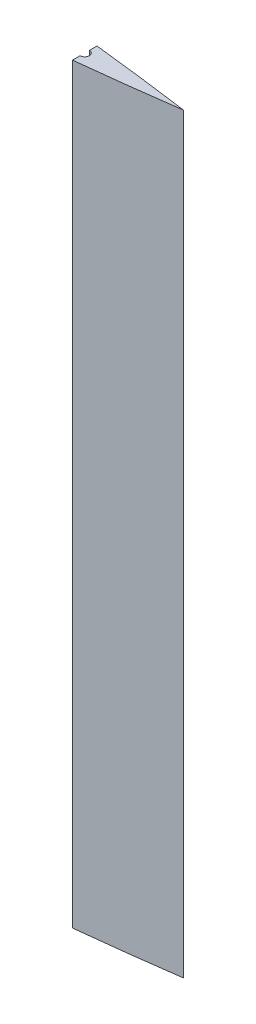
from build123d import *

# Parameters (mm, degrees)
BOSS_EXTRUDE1_DEPTH     = 3.175
SKETCH2_R               = 1.5
CUT_EXTRUDE1_DEPTH      = 3.175
SKETCH3_R               = 1.5
CUT_EXTRUDE2_DEPTH      = 1.5875
CUT_EXTRUDE3_DEPTH      = 75.025896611
CUT_EXTRUDE3_DEPTH_BACK = 75.025896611
BOSS_EXTRUDE2_START     = 244
BOSS_EXTRUDE2_DEPTH     = 244
CUT_EXTRUDE4_DEPTH      = 252.925452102
CUT_EXTRUDE4_DEPTH_BACK = 252.925452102


with BuildPart() as part:
    # Sketch1 → Boss-Extrude1 (new body)
    with BuildSketch(Plane(origin=(0, 0, 0), x_dir=(1, 0, 0), z_dir=(0, 1, 0))):
        with BuildLine():
            Line((67.779039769, 0.131246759), (67.797892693, 0.119555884))
            add(Edge.make_bspline(
                [(67.779039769, 0.131246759), (65.03700686, 0.509034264), (59.965261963, 1.213250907), (52.554471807, 2.158374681), (45.554393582, 3.00647836), (36.223889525, 4.068832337), (26.890333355, 5.041842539), (17.553968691, 5.919437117), (10.553820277, 6.521297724), (3.553925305, 7.068029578), (-3.492800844, 7.550143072), (-10.539316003, 7.962714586), (-17.586579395, 8.268185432), (-24.587039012, 8.49389358), (-30.375678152, 8.4899488), (-34.994971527, 8.597521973), (-40.781764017, 8.678102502), (-47.788121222, 8.68162886), (-54.793770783, 8.311674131), (-59.226305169, 7.818234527), (-62.265674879, 7.319870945), (-64.600903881, 6.788432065), (-66.462046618, 6.225735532), (-67.870705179, 5.710888), (-69.287641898, 5.065294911), (-70.729671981, 4.219380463), (-71.925873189, 3.230084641), (-72.979383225, 1.905868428), (-73.75481754, 0.124102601), (-72.979383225, -1.657663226), (-71.925873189, -2.981879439), (-70.729671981, -3.971175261), (-69.287641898, -4.817089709), (-67.870705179, -5.462682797), (-66.462046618, -5.97753033), (-64.600903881, -6.540226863), (-62.265674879, -7.071665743), (-59.226305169, -7.570029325), (-54.793770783, -8.063468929), (-47.788121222, -8.433423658), (-40.781764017, -8.4298973), (-34.994971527, -8.349316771), (-30.375678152, -8.241743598), (-24.587039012, -8.245688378), (-17.586579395, -8.01998023), (-10.539316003, -7.714509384), (-3.492800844, -7.30193787), (3.553925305, -6.819824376), (10.553820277, -6.273092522), (17.553968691, -5.671231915), (26.890333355, -4.793637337), (36.223889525, -3.820627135), (45.554393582, -2.758273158), (52.554471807, -1.910169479), (59.971554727, -0.964243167), (65.049573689, -0.259084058), (67.797892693, 0.119555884)],
                knots=[-0.004320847, -0.004320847, -0.004320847, -0.004320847, 0.024634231, 0.04924287, 0.07382978, 0.098396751, 0.147478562, 0.171994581, 0.196493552, 0.220976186, 0.245442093, 0.270380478, 0.294812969, 0.319231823, 0.343641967, 0.355360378, 0.36756608, 0.404182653, 0.428636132, 0.440920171, 0.450818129, 0.460843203, 0.465945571, 0.471149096, 0.476522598, 0.482208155, 0.488618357, 0.492567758, 0.5, 0.507432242, 0.511381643, 0.517791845, 0.523477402, 0.528850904, 0.534054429, 0.539156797, 0.549181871, 0.559079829, 0.571363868, 0.595817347, 0.63243392, 0.644639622, 0.656358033, 0.680768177, 0.705187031, 0.729619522, 0.754557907, 0.779023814, 0.803506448, 0.828005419, 0.852521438, 0.901603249, 0.92617022, 0.95075713, 0.975365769, 1.004387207, 1.004387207, 1.004387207, 1.004387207], degree=3))
        make_face()
    extrude(amount=BOSS_EXTRUDE1_DEPTH)

    # Sketch2 → Cut-Extrude1 (cut)
    with BuildSketch(Plane(origin=(0, 3.175, 0), x_dir=(1, 0, 0), z_dir=(0, 1, 0))):
        with Locations(Location((35.779039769, 0.131246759, 0), (0, 0, 270))):
            Circle(SKETCH2_R)
    extrude(amount=-CUT_EXTRUDE1_DEPTH, mode=Mode.SUBTRACT)

    # Sketch3 → Cut-Extrude2 (cut)
    with BuildSketch(Plane.XZ):
        with Locations(Location((-52.19848551, -0.119555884, 0), (0, 0, 270))):
            Circle(SKETCH3_R)
    extrude(amount=-CUT_EXTRUDE2_DEPTH, mode=Mode.SUBTRACT)

    # Sketch4 → Cut-Extrude3 (cut, two sides: drawn at the far end of the back side and taken through both)
    with BuildSketch(Plane(origin=(0, 3.175, 0), x_dir=(1, 0, 0), z_dir=(0, 1, 0)).offset(-CUT_EXTRUDE3_DEPTH_BACK)):
        with BuildLine():
            Line((35.779039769, 4.09956648), (35.779039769, 1.631246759))
            ThreePointArc((35.779039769, 1.631246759), (37.279039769, 0.131246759), (35.779039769, -1.368753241))
            Line((35.779039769, -1.368753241), (35.779039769, -3.851361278))
            add(Edge.make_bspline(
                [(35.779039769, -3.851361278), (36.703324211, -3.751450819), (39.962012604, -3.395011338), (45.554393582, -2.758273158), (52.554471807, -1.910169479), (59.971554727, -0.964243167), (65.049573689, -0.259084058), (67.797892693, 0.119555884)],
                knots=[0.891878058, 0.891878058, 0.891878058, 0.891878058, 0.901603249, 0.92617022, 0.95075713, 0.975365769, 1.004387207, 1.004387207, 1.004387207, 1.004387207], degree=3))
            Line((67.797892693, 0.119555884), (67.779039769, 0.131246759))
            add(Edge.make_bspline(
                [(67.779039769, 0.131246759), (65.03700686, 0.509034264), (59.965261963, 1.213250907), (52.554471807, 2.158374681), (45.554393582, 3.00647836), (39.962012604, 3.64321654), (36.703324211, 3.999656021), (35.779039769, 4.09956648)],
                knots=[-0.004320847, -0.004320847, -0.004320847, -0.004320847, 0.024634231, 0.04924287, 0.07382978, 0.098396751, 0.108121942, 0.108121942, 0.108121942, 0.108121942], degree=3))
        make_face()
    extrude(amount=CUT_EXTRUDE3_DEPTH + CUT_EXTRUDE3_DEPTH_BACK, mode=Mode.SUBTRACT)

    # Sketch5 → Boss-Extrude2 (add)
    with BuildSketch(Plane(origin=(0, 0, 0), x_dir=(1, 0, 0), z_dir=(0, 1, 0)).offset(BOSS_EXTRUDE2_START)):
        with BuildLine():
            Line((35.779039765, -1.368753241), (35.779039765, -3.851361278))
            add(Edge.make_bspline(
                [(35.779039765, -3.851361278), (36.703324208, -3.751450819), (39.9620126, -3.395011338), (45.554393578, -2.758273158), (52.554471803, -1.910169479), (59.971554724, -0.964243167), (65.049573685, -0.259084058), (67.79789269, 0.119555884)],
                knots=[0.891878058, 0.891878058, 0.891878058, 0.891878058, 0.901603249, 0.92617022, 0.95075713, 0.975365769, 1.004387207, 1.004387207, 1.004387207, 1.004387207], degree=3))
            Line((67.79789269, 0.119555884), (67.830893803, 0.124102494))
            Line((67.830893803, 0.124102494), (67.779039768, 0.131246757))
            add(Edge.make_bspline(
                [(67.779039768, 0.131246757), (65.03700686, 0.509034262), (59.965261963, 1.213250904), (52.554471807, 2.158374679), (45.554393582, 3.006478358), (39.962012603, 3.643216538), (36.703324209, 3.999656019), (35.779039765, 4.099566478)],
                knots=[-0.004320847, -0.004320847, -0.004320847, -0.004320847, 0.024634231, 0.04924287, 0.07382978, 0.098396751, 0.108121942, 0.108121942, 0.108121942, 0.108121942], degree=3))
            Line((35.779039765, 4.099566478), (35.779039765, 1.631246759))
            ThreePointArc((35.779039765, 1.631246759), (37.279039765, 0.131246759), (35.779039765, -1.368753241))
        make_face()
    extrude(amount=-BOSS_EXTRUDE2_DEPTH)

    # Sketch6 → Cut-Extrude4 (cut, two sides: drawn at the far end of the back side and taken through both)
    with BuildSketch(Plane(origin=(0, 3.175, 0), x_dir=(1, 0, 0), z_dir=(0, 1, 0)).offset(-CUT_EXTRUDE4_DEPTH_BACK)):
        with BuildLine():
            Line((35.77903977, -3.851388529), (35.779039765, -1.368753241))
            ThreePointArc((35.779039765, -1.368753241), (34.279039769, 0.131246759), (35.779039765, 1.631246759))
            Line((35.779039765, 1.631246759), (35.779039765, 4.099593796))
            add(Edge.make_bspline(
                [(35.779039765, 4.099593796), (32.0385543, 4.503921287), (25.964676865, 5.128879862), (17.553853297, 5.919475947), (10.553658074, 6.521340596), (3.553716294, 7.068076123), (-3.493056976, 7.550192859), (-10.539619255, 7.962767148), (-17.586929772, 8.268240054), (-24.587436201, 8.493949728), (-30.37611405, 8.490004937), (-34.995438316, 8.59757884), (-40.782269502, 8.678159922), (-47.788673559, 8.681686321), (-54.794369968, 8.311729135), (-59.226933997, 7.818286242), (-62.266324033, 7.319919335), (-64.601568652, 6.788476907), (-66.462723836, 6.225776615), (-67.871391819, 5.710925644), (-69.288338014, 5.065328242), (-70.730377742, 4.219408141), (-71.926586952, 3.230105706), (-72.980104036, 1.90588064), (-73.75554354, 0.1241029), (-72.980104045, -1.657674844), (-71.926586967, -2.981899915), (-70.730377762, -3.971202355), (-69.288338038, -4.817122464), (-67.871391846, -5.462719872), (-66.462723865, -5.977570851), (-64.601568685, -6.540271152), (-62.266324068, -7.071713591), (-59.226934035, -7.570080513), (-54.794370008, -8.063523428), (-47.788673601, -8.433480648), (-40.782269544, -8.429954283), (-34.995438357, -8.34937323), (-30.376114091, -8.241799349), (-24.587436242, -8.245744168), (-17.586929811, -8.020034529), (-10.539619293, -7.714561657), (-3.493057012, -7.301987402), (3.55371626, -6.819870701), (10.553658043, -6.273135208), (17.553853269, -5.671270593), (25.964676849, -4.880674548), (32.038554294, -4.255716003), (35.77903977, -3.851388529)],
                knots=[0.108121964, 0.108121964, 0.108121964, 0.108121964, 0.147478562, 0.171994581, 0.196493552, 0.220976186, 0.245442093, 0.270380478, 0.294812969, 0.319231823, 0.343641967, 0.355360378, 0.36756608, 0.404182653, 0.428636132, 0.440920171, 0.450818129, 0.460843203, 0.465945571, 0.471149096, 0.476522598, 0.482208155, 0.488618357, 0.492567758, 0.5, 0.507432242, 0.511381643, 0.517791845, 0.523477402, 0.528850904, 0.534054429, 0.539156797, 0.549181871, 0.559079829, 0.571363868, 0.595817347, 0.63243392, 0.644639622, 0.656358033, 0.680768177, 0.705187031, 0.729619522, 0.754557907, 0.779023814, 0.803506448, 0.828005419, 0.852521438, 0.891878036, 0.891878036, 0.891878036, 0.891878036], degree=3))
        make_face()
    extrude(amount=CUT_EXTRUDE4_DEPTH + CUT_EXTRUDE4_DEPTH_BACK, mode=Mode.SUBTRACT)


solid = part.part
